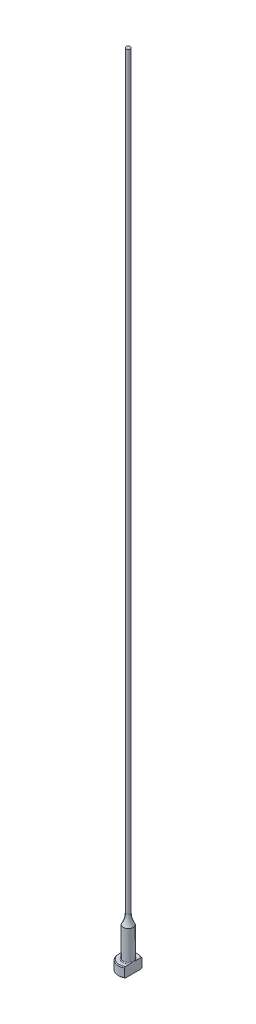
ISO-10303-21;
HEADER;
FILE_DESCRIPTION(('STEP AP214'),'2;1');
FILE_NAME('part.step','',(''),(''),'','','');
FILE_SCHEMA(('AUTOMOTIVE_DESIGN { 1 0 10303 214 1 1 1 1 }'));
ENDSEC;
DATA;
#1=APPLICATION_CONTEXT('core data for automotive mechanical design processes');
#2=APPLICATION_PROTOCOL_DEFINITION('international standard','automotive_design',2000,#1);
#3=PRODUCT_CONTEXT('',#1,'mechanical');
#4=PRODUCT('Part','Part','',(#3));
#5=PRODUCT_RELATED_PRODUCT_CATEGORY('part','',(#4));
#6=PRODUCT_DEFINITION_FORMATION('','',#4);
#7=PRODUCT_DEFINITION_CONTEXT('part definition',#1,'design');
#8=PRODUCT_DEFINITION('design','',#6,#7);
#9=PRODUCT_DEFINITION_SHAPE('','',#8);
#10=(LENGTH_UNIT() NAMED_UNIT(*) SI_UNIT(.MILLI.,.METRE.));
#11=(NAMED_UNIT(*) PLANE_ANGLE_UNIT() SI_UNIT($,.RADIAN.));
#12=(NAMED_UNIT(*) SI_UNIT($,.STERADIAN.) SOLID_ANGLE_UNIT());
#13=UNCERTAINTY_MEASURE_WITH_UNIT(LENGTH_MEASURE(1.E-05),#10,'distance_accuracy_value','');
#14=(GEOMETRIC_REPRESENTATION_CONTEXT(3) GLOBAL_UNCERTAINTY_ASSIGNED_CONTEXT((#13)) GLOBAL_UNIT_ASSIGNED_CONTEXT((#10,
#11,#12)) REPRESENTATION_CONTEXT('',''));
#15=CARTESIAN_POINT('',(0.,0.,0.));
#16=DIRECTION('',(0.,0.,1.));
#17=DIRECTION('',(1.,0.,0.));
#18=AXIS2_PLACEMENT_3D('',#15,#16,#17);
#19=CARTESIAN_POINT('',(-3.17499999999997,3.175,0.));
#20=DIRECTION('',(0.,1.,0.));
#21=DIRECTION('',(0.,0.,1.));
#22=AXIS2_PLACEMENT_3D('',#19,#20,#21);
#23=PLANE('',#22);
#24=CARTESIAN_POINT('',(0.,3.175,0.));
#25=DIRECTION('',(0.,1.,0.));
#26=DIRECTION('',(0.,0.,1.));
#27=AXIS2_PLACEMENT_3D('',#24,#25,#26);
#28=CIRCLE('',#27,2.92099999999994);
#29=CARTESIAN_POINT('',(1.58749999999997,3.175,-2.45195529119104));
#30=VERTEX_POINT('',#29);
#31=CARTESIAN_POINT('',(1.58749999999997,3.175,2.45195529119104));
#32=VERTEX_POINT('',#31);
#33=EDGE_CURVE('E105',#30,#32,#28,.T.);
#34=ORIENTED_EDGE('',*,*,#33,.T.);
#35=DIRECTION('',(0.,0.,1.));
#36=VECTOR('',#35,1.);
#37=CARTESIAN_POINT('',(1.58749999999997,3.17499999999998,2.74963065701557));
#38=LINE('',#37,#36);
#39=CARTESIAN_POINT('',(1.58749999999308,3.175,0.933255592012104));
#40=VERTEX_POINT('',#39);
#41=EDGE_CURVE('E126',#40,#32,#38,.T.);
#42=ORIENTED_EDGE('',*,*,#41,.F.);
#43=CARTESIAN_POINT('',(0.,3.175,0.));
#44=DIRECTION('',(0.,1.,0.));
#45=DIRECTION('',(0.,0.,1.));
#46=AXIS2_PLACEMENT_3D('',#43,#44,#45);
#47=CIRCLE('',#46,1.84149999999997);
#48=CARTESIAN_POINT('',(1.58749999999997,3.17500000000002,-0.933255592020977));
#49=VERTEX_POINT('',#48);
#50=EDGE_CURVE('E11',#40,#49,#47,.F.);
#51=ORIENTED_EDGE('',*,*,#50,.T.);
#52=EDGE_CURVE('E52',#30,#49,#38,.T.);
#53=ORIENTED_EDGE('',*,*,#52,.F.);
#54=EDGE_LOOP('',(#34,#42,#51,#53));
#55=FACE_BOUND('',#54,.T.);
#56=ADVANCED_FACE('F32',(#55),#23,.T.);
#57=CARTESIAN_POINT('',(0.,259.958771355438,0.));
#58=DIRECTION('',(0.,1.,0.));
#59=DIRECTION('',(0.,0.,1.));
#60=AXIS2_PLACEMENT_3D('',#57,#58,#59);
#61=CYLINDRICAL_SURFACE('',#60,3.17499999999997);
#62=CARTESIAN_POINT('',(0.,2.92100000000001,0.));
#63=DIRECTION('',(0.,1.,0.));
#64=DIRECTION('',(0.,0.,1.));
#65=AXIS2_PLACEMENT_3D('',#62,#63,#64);
#66=CIRCLE('',#65,3.17499999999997);
#67=CARTESIAN_POINT('',(1.58749999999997,2.92100000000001,2.74963065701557));
#68=VERTEX_POINT('',#67);
#69=CARTESIAN_POINT('',(1.58749999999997,2.92100000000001,-2.74963065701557));
#70=VERTEX_POINT('',#69);
#71=EDGE_CURVE('E98',#68,#70,#66,.F.);
#72=ORIENTED_EDGE('',*,*,#71,.T.);
#73=DIRECTION('',(0.,-1.,0.));
#74=VECTOR('',#73,1.);
#75=CARTESIAN_POINT('',(1.58749999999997,254.001,-2.74963065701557));
#76=LINE('',#75,#74);
#77=CARTESIAN_POINT('',(1.58749999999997,0.253999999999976,-2.74963065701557));
#78=VERTEX_POINT('',#77);
#79=EDGE_CURVE('E141',#70,#78,#76,.T.);
#80=ORIENTED_EDGE('',*,*,#79,.T.);
#81=CARTESIAN_POINT('',(0.,0.253999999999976,0.));
#82=DIRECTION('',(0.,-1.,0.));
#83=DIRECTION('',(0.,0.,-1.));
#84=AXIS2_PLACEMENT_3D('',#81,#82,#83);
#85=CIRCLE('',#84,3.17499999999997);
#86=CARTESIAN_POINT('',(1.58749999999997,0.253999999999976,2.74963065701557));
#87=VERTEX_POINT('',#86);
#88=EDGE_CURVE('E95',#78,#87,#85,.F.);
#89=ORIENTED_EDGE('',*,*,#88,.T.);
#90=DIRECTION('',(0.,-1.,0.));
#91=VECTOR('',#90,1.);
#92=CARTESIAN_POINT('',(1.58749999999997,254.001,2.74963065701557));
#93=LINE('',#92,#91);
#94=EDGE_CURVE('E88',#68,#87,#93,.T.);
#95=ORIENTED_EDGE('',*,*,#94,.F.);
#96=EDGE_LOOP('',(#72,#80,#89,#95));
#97=FACE_BOUND('',#96,.T.);
#98=ADVANCED_FACE('F191',(#97),#61,.T.);
#99=CARTESIAN_POINT('',(0.,0.,0.));
#100=DIRECTION('',(0.,-1.,0.));
#101=DIRECTION('',(0.,0.,-1.));
#102=AXIS2_PLACEMENT_3D('',#99,#100,#101);
#103=PLANE('',#102);
#104=CARTESIAN_POINT('',(0.,0.,0.));
#105=DIRECTION('',(0.,-1.,0.));
#106=DIRECTION('',(0.,0.,-1.));
#107=AXIS2_PLACEMENT_3D('',#104,#105,#106);
#108=CIRCLE('',#107,2.92100000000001);
#109=CARTESIAN_POINT('',(1.58749999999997,0.,2.45195529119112));
#110=VERTEX_POINT('',#109);
#111=CARTESIAN_POINT('',(1.58749999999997,0.,-2.45195529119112));
#112=VERTEX_POINT('',#111);
#113=EDGE_CURVE('E93',#110,#112,#108,.T.);
#114=ORIENTED_EDGE('',*,*,#113,.T.);
#115=DIRECTION('',(0.,0.,1.));
#116=VECTOR('',#115,1.);
#117=CARTESIAN_POINT('',(1.58749999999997,0.,2.74963065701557));
#118=LINE('',#117,#116);
#119=EDGE_CURVE('E78',#112,#110,#118,.T.);
#120=ORIENTED_EDGE('',*,*,#119,.T.);
#121=EDGE_LOOP('',(#114,#120));
#122=FACE_BOUND('',#121,.T.);
#123=ADVANCED_FACE('F97',(#122),#103,.T.);
#124=CARTESIAN_POINT('',(0.,3.17499999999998,0.));
#125=DIRECTION('',(0.,-1.,0.));
#126=DIRECTION('',(0.,0.,-1.));
#127=AXIS2_PLACEMENT_3D('',#124,#125,#126);
#128=CONICAL_SURFACE('',#127,2.92099999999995,0.785398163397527);
#129=ORIENTED_EDGE('',*,*,#71,.F.);
#130=CARTESIAN_POINT('',(1.58749999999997,-0.16162066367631,-6.0529050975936));
#131=CARTESIAN_POINT('',(1.58749999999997,-0.0288893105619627,-5.91567682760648));
#132=CARTESIAN_POINT('',(1.58749999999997,0.103699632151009,-5.7783103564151));
#133=CARTESIAN_POINT('',(1.58749999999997,0.368508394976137,-5.50321874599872));
#134=CARTESIAN_POINT('',(1.58749999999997,0.500728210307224,-5.36549360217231));
#135=CARTESIAN_POINT('',(1.58749999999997,0.764778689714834,-5.08953516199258));
#136=CARTESIAN_POINT('',(1.58749999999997,0.896609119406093,-4.9513016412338));
#137=CARTESIAN_POINT('',(1.58749999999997,1.15968706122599,-4.67428233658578));
#138=CARTESIAN_POINT('',(1.58749999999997,1.29093457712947,-4.53549655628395));
#139=CARTESIAN_POINT('',(1.58749999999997,1.55007705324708,-4.25997724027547));
#140=CARTESIAN_POINT('',(1.58749999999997,1.67798684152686,-4.12325766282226));
#141=CARTESIAN_POINT('',(1.58749999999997,1.9328486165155,-3.84892898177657));
#142=CARTESIAN_POINT('',(1.58749999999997,2.05980060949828,-3.71131988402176));
#143=CARTESIAN_POINT('',(1.58749999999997,2.31237508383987,-3.43493978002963));
#144=CARTESIAN_POINT('',(1.58749999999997,2.43799784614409,-3.29616903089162));
#145=CARTESIAN_POINT('',(1.58749999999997,2.68741369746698,-3.01699558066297));
#146=CARTESIAN_POINT('',(1.58749999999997,2.81120686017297,-2.8765929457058));
#147=CARTESIAN_POINT('',(1.58749999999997,3.00875865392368,-2.64816703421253));
#148=CARTESIAN_POINT('',(1.58749999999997,3.08336151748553,-2.56087478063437));
#149=CARTESIAN_POINT('',(1.58749999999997,3.2312387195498,-2.38515423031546));
#150=CARTESIAN_POINT('',(1.58749999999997,3.30451292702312,-2.29672582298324));
#151=CARTESIAN_POINT('',(1.58749999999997,3.45004422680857,-2.1174740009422));
#152=CARTESIAN_POINT('',(1.58749999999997,3.5222823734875,-2.02663514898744));
#153=CARTESIAN_POINT('',(1.58749999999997,3.66423097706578,-1.8430252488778));
#154=CARTESIAN_POINT('',(1.58749999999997,3.73394203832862,-1.75025467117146));
#155=CARTESIAN_POINT('',(1.58749999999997,3.87080633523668,-1.5606747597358));
#156=CARTESIAN_POINT('',(1.58749999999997,3.93790459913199,-1.46382547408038));
#157=CARTESIAN_POINT('',(1.58749999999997,4.06669147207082,-1.26632594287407));
#158=CARTESIAN_POINT('',(1.58749999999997,4.1283726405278,-1.16567073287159));
#159=CARTESIAN_POINT('',(1.58749999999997,4.21402252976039,-1.01165766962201));
#160=CARTESIAN_POINT('',(1.58749999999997,4.24127929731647,-0.960142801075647));
#161=CARTESIAN_POINT('',(1.58749999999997,4.2930979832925,-0.855780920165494));
#162=CARTESIAN_POINT('',(1.58749999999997,4.31765941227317,-0.802933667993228));
#163=CARTESIAN_POINT('',(1.58749999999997,4.38614656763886,-0.642461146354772));
#164=CARTESIAN_POINT('',(1.58749999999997,4.42510149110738,-0.532518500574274));
#165=CARTESIAN_POINT('',(1.58749999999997,4.46726244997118,-0.367680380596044));
#166=CARTESIAN_POINT('',(1.58749999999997,4.47844427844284,-0.314802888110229));
#167=CARTESIAN_POINT('',(1.58749999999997,4.49576654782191,-0.208209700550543));
#168=CARTESIAN_POINT('',(1.58749999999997,4.50190743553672,-0.154494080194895));
#169=CARTESIAN_POINT('',(1.58749999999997,4.50871296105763,-0.0468792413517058));
#170=CARTESIAN_POINT('',(1.58749999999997,4.5093945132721,0.00701889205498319));
#171=CARTESIAN_POINT('',(1.58749999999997,4.50527679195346,0.114606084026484));
#172=CARTESIAN_POINT('',(1.58749999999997,4.50047706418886,0.168295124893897));
#173=CARTESIAN_POINT('',(1.58749999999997,4.48579689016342,0.27448544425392));
#174=CARTESIAN_POINT('',(1.58749999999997,4.47596081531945,0.32699298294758));
#175=CARTESIAN_POINT('',(1.58749999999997,4.45181809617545,0.430974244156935));
#176=CARTESIAN_POINT('',(1.58749999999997,4.4375096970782,0.482447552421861));
#177=CARTESIAN_POINT('',(1.58749999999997,4.40502489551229,0.584460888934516));
#178=CARTESIAN_POINT('',(1.58749999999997,4.386827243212,0.634994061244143));
#179=CARTESIAN_POINT('',(1.58749999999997,4.34729308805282,0.734789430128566));
#180=CARTESIAN_POINT('',(1.58749999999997,4.3259572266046,0.784051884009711));
#181=CARTESIAN_POINT('',(1.58749999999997,4.25791922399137,0.930549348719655));
#182=CARTESIAN_POINT('',(1.58749999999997,4.20736047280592,1.0259880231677));
#183=CARTESIAN_POINT('',(1.58749999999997,4.0995545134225,1.21304313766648));
#184=CARTESIAN_POINT('',(1.58749999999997,4.04229912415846,1.30465471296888));
#185=CARTESIAN_POINT('',(1.58749999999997,3.92308746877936,1.48526211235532));
#186=CARTESIAN_POINT('',(1.58749999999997,3.86111349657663,1.57424615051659));
#187=CARTESIAN_POINT('',(1.58749999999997,3.73408621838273,1.74990003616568));
#188=CARTESIAN_POINT('',(1.58749999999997,3.66903444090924,1.83657099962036));
#189=CARTESIAN_POINT('',(1.58749999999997,3.53583371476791,2.00931764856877));
#190=CARTESIAN_POINT('',(1.58749999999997,3.46765527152,2.09537048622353));
#191=CARTESIAN_POINT('',(1.58749999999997,3.32960643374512,2.26611736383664));
#192=CARTESIAN_POINT('',(1.58749999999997,3.25973586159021,2.35081125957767));
#193=CARTESIAN_POINT('',(1.58749999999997,3.04858139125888,2.60290121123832));
#194=CARTESIAN_POINT('',(1.58749999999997,2.90542388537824,2.76872537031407));
#195=CARTESIAN_POINT('',(1.58749999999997,2.64069522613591,3.06970913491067));
#196=CARTESIAN_POINT('',(1.58749999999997,2.51959458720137,3.20528660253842));
#197=CARTESIAN_POINT('',(1.58749999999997,2.27590400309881,3.47510321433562));
#198=CARTESIAN_POINT('',(1.58749999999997,2.15331401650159,3.60934232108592));
#199=CARTESIAN_POINT('',(1.58749999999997,1.90694239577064,3.87695374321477));
#200=CARTESIAN_POINT('',(1.58749999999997,1.78315974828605,4.0103251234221));
#201=CARTESIAN_POINT('',(1.58749999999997,1.53478104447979,4.27630880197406));
#202=CARTESIAN_POINT('',(1.58749999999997,1.41018498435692,4.40892109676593));
#203=CARTESIAN_POINT('',(1.58749999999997,1.0457468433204,4.79499418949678));
#204=CARTESIAN_POINT('',(1.58749999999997,0.80507680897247,5.04767313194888));
#205=CARTESIAN_POINT('',(1.58749999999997,0.443121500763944,5.42550911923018));
#206=CARTESIAN_POINT('',(1.58749999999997,0.322378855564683,5.55118772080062));
#207=CARTESIAN_POINT('',(1.58749999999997,0.0805914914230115,5.80225207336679));
#208=CARTESIAN_POINT('',(1.58749999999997,-0.040453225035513,5.92763782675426));
#209=CARTESIAN_POINT('',(1.58749999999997,-0.161620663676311,6.0529050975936));
#210=B_SPLINE_CURVE_WITH_KNOTS('',3,(#130,#131,#132,#133,#134,#135,#136,#137,#138,#139,#140,
#141,#142,#143,#144,#145,#146,#147,#148,#149,#150,#151,#152,#153,#154,#155,#156,#157,#158,#159,
#160,#161,#162,#163,#164,#165,#166,#167,#168,#169,#170,#171,#172,#173,#174,#175,#176,#177,#178,
#179,#180,#181,#182,#183,#184,#185,#186,#187,#188,#189,#190,#191,#192,#193,#194,#195,#196,#197,
#198,#199,#200,#201,#202,#203,#204,#205,#206,#207,#208,#209),.UNSPECIFIED.,.F.,.F.,(4,2,2,2,2,2,
2,2,2,2,2,2,2,2,2,2,2,2,2,2,2,2,2,2,2,2,2,2,2,2,2,2,2,2,2,2,2,2,2,4),(0.,0.572750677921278,
1.14550874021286,1.71856057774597,2.29160869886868,2.85328006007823,3.4149477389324,
3.97649423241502,4.53801804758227,4.88249307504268,5.22700189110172,5.5751532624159,
5.92322081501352,6.27657800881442,6.63041319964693,6.80518126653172,6.9799810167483,
7.3282426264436,7.49018491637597,7.65211285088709,7.81353889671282,7.97497832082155,
8.13501929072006,8.29512313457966,8.45612518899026,8.61709438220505,8.94062993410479,
9.2645649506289,9.58978187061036,9.91483894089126,10.2441741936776,10.5735441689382,
11.2306812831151,11.7760337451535,12.3214014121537,12.8672825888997,13.4131663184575,
14.4600164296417,14.9828595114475,15.5056983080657),.UNSPECIFIED.);
#211=EDGE_CURVE('E118',#32,#68,#210,.T.);
#212=ORIENTED_EDGE('',*,*,#211,.F.);
#213=ORIENTED_EDGE('',*,*,#33,.F.);
#214=EDGE_CURVE('E117',#70,#30,#210,.T.);
#215=ORIENTED_EDGE('',*,*,#214,.F.);
#216=EDGE_LOOP('',(#129,#212,#213,#215));
#217=FACE_BOUND('',#216,.T.);
#218=ADVANCED_FACE('F162',(#217),#128,.T.);
#219=CARTESIAN_POINT('',(0.,0.253999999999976,0.));
#220=DIRECTION('',(0.,1.,0.));
#221=DIRECTION('',(0.,0.,1.));
#222=AXIS2_PLACEMENT_3D('',#219,#220,#221);
#223=CONICAL_SURFACE('',#222,3.17499999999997,0.785398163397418);
#224=ORIENTED_EDGE('',*,*,#88,.F.);
#225=CARTESIAN_POINT('',(1.58749999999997,3.33662066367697,6.0529050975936));
#226=CARTESIAN_POINT('',(1.58749999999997,3.20388931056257,5.91567682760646));
#227=CARTESIAN_POINT('',(1.58749999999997,3.07130036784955,5.77831035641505));
#228=CARTESIAN_POINT('',(1.58749999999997,2.80649160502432,5.50321874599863));
#229=CARTESIAN_POINT('',(1.58749999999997,2.67427178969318,5.3654936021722));
#230=CARTESIAN_POINT('',(1.58749999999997,2.41022131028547,5.08953516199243));
#231=CARTESIAN_POINT('',(1.58749999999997,2.27839088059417,4.95130164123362));
#232=CARTESIAN_POINT('',(1.58749999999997,2.01531293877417,4.67428233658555));
#233=CARTESIAN_POINT('',(1.58749999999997,1.88406542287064,4.5354965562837));
#234=CARTESIAN_POINT('',(1.58749999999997,1.62492294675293,4.25997724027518));
#235=CARTESIAN_POINT('',(1.58749999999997,1.49701315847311,4.12325766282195));
#236=CARTESIAN_POINT('',(1.58749999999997,1.24215138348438,3.84892898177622));
#237=CARTESIAN_POINT('',(1.58749999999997,1.11519939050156,3.71131988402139));
#238=CARTESIAN_POINT('',(1.58749999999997,0.862624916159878,3.43493978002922));
#239=CARTESIAN_POINT('',(1.58749999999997,0.737002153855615,3.29616903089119));
#240=CARTESIAN_POINT('',(1.58749999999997,0.487586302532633,3.01699558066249));
#241=CARTESIAN_POINT('',(1.58749999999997,0.363793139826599,2.8765929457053));
#242=CARTESIAN_POINT('',(1.58749999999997,0.166241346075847,2.64816703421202));
#243=CARTESIAN_POINT('',(1.58749999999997,0.0916384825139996,2.56087478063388));
#244=CARTESIAN_POINT('',(1.58749999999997,-0.0562387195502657,2.385154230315));
#245=CARTESIAN_POINT('',(1.58749999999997,-0.129512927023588,2.29672582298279));
#246=CARTESIAN_POINT('',(1.58749999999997,-0.27504422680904,2.11747400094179));
#247=CARTESIAN_POINT('',(1.58749999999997,-0.347282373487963,2.02663514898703));
#248=CARTESIAN_POINT('',(1.58749999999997,-0.489230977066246,1.84302524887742));
#249=CARTESIAN_POINT('',(1.58749999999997,-0.558942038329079,1.7502546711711));
#250=CARTESIAN_POINT('',(1.58749999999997,-0.695806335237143,1.56067475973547));
#251=CARTESIAN_POINT('',(1.58749999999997,-0.762904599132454,1.46382547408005));
#252=CARTESIAN_POINT('',(1.58749999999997,-0.891691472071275,1.26632594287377));
#253=CARTESIAN_POINT('',(1.58749999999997,-0.953372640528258,1.16567073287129));
#254=CARTESIAN_POINT('',(1.58749999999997,-1.03902252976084,1.01165766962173));
#255=CARTESIAN_POINT('',(1.58749999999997,-1.06627929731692,0.960142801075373));
#256=CARTESIAN_POINT('',(1.58749999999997,-1.11809798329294,0.85578092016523));
#257=CARTESIAN_POINT('',(1.58749999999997,-1.14265941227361,0.802933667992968));
#258=CARTESIAN_POINT('',(1.58749999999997,-1.21114656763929,0.642461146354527));
#259=CARTESIAN_POINT('',(1.58749999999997,-1.2501014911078,0.532518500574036));
#260=CARTESIAN_POINT('',(1.58749999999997,-1.29226244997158,0.367680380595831));
#261=CARTESIAN_POINT('',(1.58749999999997,-1.30344427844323,0.314802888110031));
#262=CARTESIAN_POINT('',(1.58749999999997,-1.32076654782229,0.208209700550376));
#263=CARTESIAN_POINT('',(1.58749999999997,-1.3269074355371,0.154494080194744));
#264=CARTESIAN_POINT('',(1.58749999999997,-1.333712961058,0.0468792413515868));
#265=CARTESIAN_POINT('',(1.58749999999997,-1.33439451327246,-0.00701889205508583));
#266=CARTESIAN_POINT('',(1.58749999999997,-1.33027679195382,-0.114606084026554));
#267=CARTESIAN_POINT('',(1.58749999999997,-1.32547706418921,-0.168295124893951));
#268=CARTESIAN_POINT('',(1.58749999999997,-1.31079689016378,-0.274485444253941));
#269=CARTESIAN_POINT('',(1.58749999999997,-1.3009608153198,-0.326992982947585));
#270=CARTESIAN_POINT('',(1.58749999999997,-1.27681809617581,-0.430974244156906));
#271=CARTESIAN_POINT('',(1.58749999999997,-1.26250969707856,-0.482447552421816));
#272=CARTESIAN_POINT('',(1.58749999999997,-1.23002489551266,-0.584460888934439));
#273=CARTESIAN_POINT('',(1.58749999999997,-1.21182724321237,-0.634994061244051));
#274=CARTESIAN_POINT('',(1.58749999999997,-1.1722930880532,-0.734789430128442));
#275=CARTESIAN_POINT('',(1.58749999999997,-1.15095722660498,-0.784051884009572));
#276=CARTESIAN_POINT('',(1.58749999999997,-1.08291922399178,-0.93054934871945));
#277=CARTESIAN_POINT('',(1.58749999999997,-1.03236047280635,-1.02598802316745));
#278=CARTESIAN_POINT('',(1.58749999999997,-0.924554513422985,-1.21304313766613));
#279=CARTESIAN_POINT('',(1.58749999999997,-0.86729912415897,-1.30465471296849));
#280=CARTESIAN_POINT('',(1.58749999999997,-0.748087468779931,-1.48526211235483));
#281=CARTESIAN_POINT('',(1.58749999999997,-0.686113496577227,-1.57424615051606));
#282=CARTESIAN_POINT('',(1.58749999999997,-0.55908621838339,-1.74990003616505));
#283=CARTESIAN_POINT('',(1.58749999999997,-0.494034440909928,-1.83657099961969));
#284=CARTESIAN_POINT('',(1.58749999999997,-0.360833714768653,-2.00931764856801));
#285=CARTESIAN_POINT('',(1.58749999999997,-0.292655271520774,-2.09537048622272));
#286=CARTESIAN_POINT('',(1.58749999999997,-0.154606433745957,-2.26611736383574));
#287=CARTESIAN_POINT('',(1.58749999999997,-0.0847358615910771,-2.35081125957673));
#288=CARTESIAN_POINT('',(1.58749999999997,0.126418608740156,-2.60290121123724));
#289=CARTESIAN_POINT('',(1.58749999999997,0.269576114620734,-2.76872537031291));
#290=CARTESIAN_POINT('',(1.58749999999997,0.534304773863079,-3.06970913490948));
#291=CARTESIAN_POINT('',(1.58749999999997,0.655405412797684,-3.20528660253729));
#292=CARTESIAN_POINT('',(1.58749999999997,0.899095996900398,-3.47510321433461));
#293=CARTESIAN_POINT('',(1.58749999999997,1.02168598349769,-3.60934232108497));
#294=CARTESIAN_POINT('',(1.58749999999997,1.26805760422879,-3.87695374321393));
#295=CARTESIAN_POINT('',(1.58749999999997,1.39184025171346,-4.01032512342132));
#296=CARTESIAN_POINT('',(1.58749999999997,1.64021895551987,-4.2763088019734));
#297=CARTESIAN_POINT('',(1.58749999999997,1.76481501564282,-4.40892109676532));
#298=CARTESIAN_POINT('',(1.58749999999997,2.12925315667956,-4.79499418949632));
#299=CARTESIAN_POINT('',(1.58749999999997,2.36992319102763,-5.04767313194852));
#300=CARTESIAN_POINT('',(1.58749999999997,2.73187849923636,-5.42550911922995));
#301=CARTESIAN_POINT('',(1.58749999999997,2.85262114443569,-5.55118772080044));
#302=CARTESIAN_POINT('',(1.58749999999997,3.09440850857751,-5.8022520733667));
#303=CARTESIAN_POINT('',(1.58749999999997,3.2154532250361,-5.92763782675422));
#304=CARTESIAN_POINT('',(1.58749999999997,3.33662066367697,-6.0529050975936));
#305=B_SPLINE_CURVE_WITH_KNOTS('',3,(#225,#226,#227,#228,#229,#230,#231,#232,#233,#234,#235,
#236,#237,#238,#239,#240,#241,#242,#243,#244,#245,#246,#247,#248,#249,#250,#251,#252,#253,#254,
#255,#256,#257,#258,#259,#260,#261,#262,#263,#264,#265,#266,#267,#268,#269,#270,#271,#272,#273,
#274,#275,#276,#277,#278,#279,#280,#281,#282,#283,#284,#285,#286,#287,#288,#289,#290,#291,#292,
#293,#294,#295,#296,#297,#298,#299,#300,#301,#302,#303,#304),.UNSPECIFIED.,.F.,.F.,(4,2,2,2,2,2,
2,2,2,2,2,2,2,2,2,2,2,2,2,2,2,2,2,2,2,2,2,2,2,2,2,2,2,2,2,2,2,2,2,4),(0.,0.57275067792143,
1.14550874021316,1.71856057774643,2.29160869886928,2.85328006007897,3.41494773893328,
3.97649423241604,4.53801804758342,4.88249307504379,5.2270018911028,5.57515326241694,
5.92322081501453,6.27657800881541,6.63041319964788,6.80518126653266,6.97998101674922,
7.32824262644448,7.49018491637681,7.65211285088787,7.81353889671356,7.97497832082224,
8.1350192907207,8.29512313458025,8.45612518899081,8.61709438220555,8.94062993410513,
9.26456495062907,9.58978187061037,9.91483894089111,10.2441741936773,10.5735441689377,
11.2306812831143,11.776033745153,12.3214014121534,12.8672825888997,13.4131663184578,
14.4600164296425,14.9828595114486,15.505698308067),.UNSPECIFIED.);
#306=EDGE_CURVE('E81',#112,#78,#305,.T.);
#307=ORIENTED_EDGE('',*,*,#306,.F.);
#308=ORIENTED_EDGE('',*,*,#113,.F.);
#309=EDGE_CURVE('E84',#87,#110,#305,.T.);
#310=ORIENTED_EDGE('',*,*,#309,.F.);
#311=EDGE_LOOP('',(#224,#307,#308,#310));
#312=FACE_BOUND('',#311,.T.);
#313=ADVANCED_FACE('F92',(#312),#223,.T.);
#314=CARTESIAN_POINT('',(0.,3.42900000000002,0.));
#315=DIRECTION('',(0.,1.,0.));
#316=DIRECTION('',(0.,0.,1.));
#317=AXIS2_PLACEMENT_3D('',#314,#315,#316);
#318=TOROIDAL_SURFACE('',#317,1.84149999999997,0.254);
#319=CARTESIAN_POINT('',(1.58749999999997,3.42900000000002,0.));
#320=CARTESIAN_POINT('',(1.58749999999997,3.42899942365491,-1.9220514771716E-10));
#321=CARTESIAN_POINT('',(1.58749999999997,3.42899884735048,-1.2261161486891E-07));
#322=CARTESIAN_POINT('',(1.58749999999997,3.42899773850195,-5.09676365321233E-07));
#323=CARTESIAN_POINT('',(1.58749999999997,3.42899720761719,-7.78176328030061E-07));
#324=CARTESIAN_POINT('',(1.58749999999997,3.42899614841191,-1.42307272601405E-06));
#325=CARTESIAN_POINT('',(1.58749999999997,3.42899562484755,-1.80713867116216E-06));
#326=CARTESIAN_POINT('',(1.58749999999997,3.42899463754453,-2.63494846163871E-06));
#327=CARTESIAN_POINT('',(1.58749999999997,3.42899417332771,-3.07814756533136E-06));
#328=CARTESIAN_POINT('',(1.58749999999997,3.42899261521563,-4.66897357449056E-06));
#329=CARTESIAN_POINT('',(1.58749999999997,3.42899159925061,-5.89404908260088E-06));
#330=CARTESIAN_POINT('',(1.58749999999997,3.42898979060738,-8.42427511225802E-06));
#331=CARTESIAN_POINT('',(1.58749999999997,3.42898899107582,-9.7248057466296E-06));
#332=CARTESIAN_POINT('',(1.58749999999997,3.42898598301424,-1.48060601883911E-05));
#333=CARTESIAN_POINT('',(1.58749999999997,3.42898393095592,-1.86838281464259E-05));
#334=CARTESIAN_POINT('',(1.58749999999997,3.42898057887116,-2.63261117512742E-05));
#335=CARTESIAN_POINT('',(1.58749999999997,3.42897922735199,-3.00687417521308E-05));
#336=CARTESIAN_POINT('',(1.58749999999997,3.42897347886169,-4.60276298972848E-05));
#337=CARTESIAN_POINT('',(1.58749999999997,3.42896911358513,-5.8247019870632E-05));
#338=CARTESIAN_POINT('',(1.58749999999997,3.42896211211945,-8.11070097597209E-05));
#339=CARTESIAN_POINT('',(1.58749999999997,3.42895931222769,-9.16953114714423E-05));
#340=CARTESIAN_POINT('',(1.58749999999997,3.42893712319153,-0.000168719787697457));
#341=CARTESIAN_POINT('',(1.58749999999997,3.42890881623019,-0.000232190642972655));
#342=CARTESIAN_POINT('',(1.58749999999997,3.42880276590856,-0.000479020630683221));
#343=CARTESIAN_POINT('',(1.58749999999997,3.42873165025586,-0.00066443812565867));
#344=CARTESIAN_POINT('',(1.58749999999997,3.42845137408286,-0.0013844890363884));
#345=CARTESIAN_POINT('',(1.58749999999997,3.42823526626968,-0.00191701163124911));
#346=CARTESIAN_POINT('',(1.58749999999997,3.42735449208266,-0.00409774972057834));
#347=CARTESIAN_POINT('',(1.58749999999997,3.42669768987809,-0.00574830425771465));
#348=CARTESIAN_POINT('',(1.58749999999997,3.4174405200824,-0.0289985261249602));
#349=CARTESIAN_POINT('',(1.58749999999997,3.40878325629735,-0.0505816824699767));
#350=CARTESIAN_POINT('',(1.58749999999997,3.39189297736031,-0.0929947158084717));
#351=CARTESIAN_POINT('',(1.58749999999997,3.38365605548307,-0.11382315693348));
#352=CARTESIAN_POINT('',(1.58749999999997,3.36635393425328,-0.157956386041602));
#353=CARTESIAN_POINT('',(1.58749999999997,3.35730391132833,-0.181267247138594));
#354=CARTESIAN_POINT('',(1.58749999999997,3.33936775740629,-0.228222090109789));
#355=CARTESIAN_POINT('',(1.58749999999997,3.33048420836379,-0.25186705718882));
#356=CARTESIAN_POINT('',(1.58749999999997,3.30894496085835,-0.310512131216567));
#357=CARTESIAN_POINT('',(1.58749999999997,3.29649449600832,-0.345588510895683));
#358=CARTESIAN_POINT('',(1.58749999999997,3.27296975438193,-0.415278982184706));
#359=CARTESIAN_POINT('',(1.58749999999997,3.26186987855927,-0.449884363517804));
#360=CARTESIAN_POINT('',(1.58749999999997,3.2395832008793,-0.524471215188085));
#361=CARTESIAN_POINT('',(1.58749999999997,3.22860862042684,-0.564517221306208));
#362=CARTESIAN_POINT('',(1.58749999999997,3.20902534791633,-0.645529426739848));
#363=CARTESIAN_POINT('',(1.58749999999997,3.20043582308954,-0.686500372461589));
#364=CARTESIAN_POINT('',(1.58749999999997,3.18611712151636,-0.771546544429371));
#365=CARTESIAN_POINT('',(1.58749999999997,3.18059550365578,-0.815658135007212));
#366=CARTESIAN_POINT('',(1.58749999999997,3.17455396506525,-0.904117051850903));
#367=CARTESIAN_POINT('',(1.58749999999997,3.17401361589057,-0.948462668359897));
#368=CARTESIAN_POINT('',(1.58749999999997,3.17898948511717,-1.02531896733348));
#369=CARTESIAN_POINT('',(1.58749999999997,3.1829739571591,-1.05792141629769));
#370=CARTESIAN_POINT('',(1.58749999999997,3.19569167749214,-1.12184393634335));
#371=CARTESIAN_POINT('',(1.58749999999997,3.20436049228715,-1.1531753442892));
#372=CARTESIAN_POINT('',(1.58749999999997,3.22236152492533,-1.19946468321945));
#373=CARTESIAN_POINT('',(1.58749999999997,3.2295150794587,-1.21526783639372));
#374=CARTESIAN_POINT('',(1.58749999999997,3.24587062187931,-1.24583726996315));
#375=CARTESIAN_POINT('',(1.58749999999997,3.25507530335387,-1.26060215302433));
#376=CARTESIAN_POINT('',(1.58749999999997,3.27378481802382,-1.28575815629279));
#377=CARTESIAN_POINT('',(1.58749999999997,3.28289001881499,-1.29644383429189));
#378=CARTESIAN_POINT('',(1.58749999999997,3.30268460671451,-1.31623154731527));
#379=CARTESIAN_POINT('',(1.58749999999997,3.31337067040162,-1.32533681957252));
#380=CARTESIAN_POINT('',(1.58749999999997,3.33349977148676,-1.33941140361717));
#381=CARTESIAN_POINT('',(1.58749999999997,3.34261446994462,-1.34484814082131));
#382=CARTESIAN_POINT('',(1.58749999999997,3.36161455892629,-1.35416329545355));
#383=CARTESIAN_POINT('',(1.58749999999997,3.37149946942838,-1.35804267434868));
#384=CARTESIAN_POINT('',(1.58749999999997,3.39188678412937,-1.36398436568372));
#385=CARTESIAN_POINT('',(1.58749999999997,3.40239309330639,-1.36603350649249));
#386=CARTESIAN_POINT('',(1.58749999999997,3.42360372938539,-1.3680840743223));
#387=CARTESIAN_POINT('',(1.58749999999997,3.43430795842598,-1.36808648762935));
#388=CARTESIAN_POINT('',(1.58749999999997,3.45433283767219,-1.36616208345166));
#389=CARTESIAN_POINT('',(1.58749999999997,3.46367506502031,-1.36444960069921));
#390=CARTESIAN_POINT('',(1.58749999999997,3.48195519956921,-1.35953338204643));
#391=CARTESIAN_POINT('',(1.58749999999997,3.49089304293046,-1.3563294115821));
#392=CARTESIAN_POINT('',(1.58749999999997,3.50850302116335,-1.34848006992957));
#393=CARTESIAN_POINT('',(1.58749999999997,3.5171531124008,-1.34378578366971));
#394=CARTESIAN_POINT('',(1.58749999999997,3.53371257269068,-1.33324445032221));
#395=CARTESIAN_POINT('',(1.58749999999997,3.54162163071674,-1.32739692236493));
#396=CARTESIAN_POINT('',(1.58749999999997,3.56107121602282,-1.31107304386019));
#397=CARTESIAN_POINT('',(1.58749999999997,3.57202221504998,-1.29989286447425));
#398=CARTESIAN_POINT('',(1.58749999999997,3.59202509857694,-1.27593566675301));
#399=CARTESIAN_POINT('',(1.58749999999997,3.60107086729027,-1.26315370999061));
#400=CARTESIAN_POINT('',(1.58749999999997,3.62186023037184,-1.22930733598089));
#401=CARTESIAN_POINT('',(1.58749999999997,3.63240584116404,-1.20751096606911));
#402=CARTESIAN_POINT('',(1.58749999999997,3.65004643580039,-1.16266144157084));
#403=CARTESIAN_POINT('',(1.58749999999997,3.65714435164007,-1.13960937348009));
#404=CARTESIAN_POINT('',(1.58749999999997,3.67265428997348,-1.07603916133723));
#405=CARTESIAN_POINT('',(1.58749999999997,3.67834921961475,-1.03486686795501));
#406=CARTESIAN_POINT('',(1.58749999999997,3.68382880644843,-0.951558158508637));
#407=CARTESIAN_POINT('',(1.58749999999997,3.68350976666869,-0.909417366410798));
#408=CARTESIAN_POINT('',(1.58749999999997,3.67745397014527,-0.811383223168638));
#409=CARTESIAN_POINT('',(1.58749999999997,3.66993873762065,-0.755610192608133));
#410=CARTESIAN_POINT('',(1.58749999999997,3.64933373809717,-0.644937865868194));
#411=CARTESIAN_POINT('',(1.58749999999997,3.63621897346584,-0.59004364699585));
#412=CARTESIAN_POINT('',(1.58749999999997,3.60740922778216,-0.485757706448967));
#413=CARTESIAN_POINT('',(1.58749999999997,3.59201096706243,-0.436281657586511));
#414=CARTESIAN_POINT('',(1.58749999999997,3.55922497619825,-0.338551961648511));
#415=CARTESIAN_POINT('',(1.58749999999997,3.5418584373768,-0.290291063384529));
#416=CARTESIAN_POINT('',(1.58749999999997,3.51760237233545,-0.225557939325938));
#417=CARTESIAN_POINT('',(1.58749999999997,3.51126413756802,-0.208874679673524));
#418=CARTESIAN_POINT('',(1.58749999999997,3.49830042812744,-0.17512392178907));
#419=CARTESIAN_POINT('',(1.58749999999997,3.49167176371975,-0.158057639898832));
#420=CARTESIAN_POINT('',(1.58749999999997,3.47585523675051,-0.117638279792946));
#421=CARTESIAN_POINT('',(1.58749999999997,3.46662970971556,-0.0943002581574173));
#422=CARTESIAN_POINT('',(1.58749999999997,3.44889695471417,-0.0497824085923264));
#423=CARTESIAN_POINT('',(1.58749999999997,3.44040039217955,-0.028598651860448));
#424=CARTESIAN_POINT('',(1.58749999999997,3.43130364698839,-0.00575168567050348));
#425=CARTESIAN_POINT('',(1.58749999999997,3.43064818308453,-0.00410451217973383));
#426=CARTESIAN_POINT('',(1.58749999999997,3.42976776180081,-0.00192459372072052));
#427=CARTESIAN_POINT('',(1.58749999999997,3.42955062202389,-0.00138952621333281));
#428=CARTESIAN_POINT('',(1.58749999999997,3.42926908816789,-0.000666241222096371));
#429=CARTESIAN_POINT('',(1.58749999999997,3.42919771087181,-0.000480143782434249));
#430=CARTESIAN_POINT('',(1.58749999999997,3.42909131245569,-0.000232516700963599));
#431=CARTESIAN_POINT('',(1.58749999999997,3.42906294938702,-0.000168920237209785));
#432=CARTESIAN_POINT('',(1.58749999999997,3.42904072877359,-9.17527162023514E-05));
#433=CARTESIAN_POINT('',(1.58749999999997,3.42903792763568,-8.11550293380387E-05));
#434=CARTESIAN_POINT('',(1.58749999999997,3.42903091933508,-5.82743948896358E-05));
#435=CARTESIAN_POINT('',(1.58749999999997,3.42902654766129,-4.60440001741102E-05));
#436=CARTESIAN_POINT('',(1.58749999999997,3.42902079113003,-3.00727682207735E-05));
#437=CARTESIAN_POINT('',(1.58749999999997,3.42901943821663,-2.63286807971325E-05));
#438=CARTESIAN_POINT('',(1.58749999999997,3.42901608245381,-1.86836529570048E-05));
#439=CARTESIAN_POINT('',(1.58749999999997,3.4290140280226,-1.48046517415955E-05));
#440=CARTESIAN_POINT('',(1.58749999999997,3.42901101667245,-9.72223943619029E-06));
#441=CARTESIAN_POINT('',(1.58749999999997,3.42901021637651,-8.42159649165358E-06));
#442=CARTESIAN_POINT('',(1.58749999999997,3.42900840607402,-5.89129729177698E-06));
#443=CARTESIAN_POINT('',(1.58749999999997,3.42900738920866,-4.66626867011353E-06));
#444=CARTESIAN_POINT('',(1.58749999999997,3.42900582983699,-3.07568803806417E-06));
#445=CARTESIAN_POINT('',(1.58749999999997,3.42900536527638,-2.63259565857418E-06));
#446=CARTESIAN_POINT('',(1.58749999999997,3.4290043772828,-1.80506085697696E-06));
#447=CARTESIAN_POINT('',(1.58749999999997,3.42900385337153,-1.42116387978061E-06));
#448=CARTESIAN_POINT('',(1.58749999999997,3.42900279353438,-7.76675643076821E-07));
#449=CARTESIAN_POINT('',(1.58749999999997,3.42900226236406,-5.08406487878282E-07));
#450=CARTESIAN_POINT('',(1.58749999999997,3.42900115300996,-1.21901887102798E-07));
#451=CARTESIAN_POINT('',(1.58749999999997,3.42900057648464,1.92251677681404E-10));
#452=CARTESIAN_POINT('',(1.58749999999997,3.42900000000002,0.));
#453=B_SPLINE_CURVE_WITH_KNOTS('',3,(#319,#320,#321,#322,#323,#324,#325,#326,#327,#328,#329,
#330,#331,#332,#333,#334,#335,#336,#337,#338,#339,#340,#341,#342,#343,#344,#345,#346,#347,#348,
#349,#350,#351,#352,#353,#354,#355,#356,#357,#358,#359,#360,#361,#362,#363,#364,#365,#366,#367,
#368,#369,#370,#371,#372,#373,#374,#375,#376,#377,#378,#379,#380,#381,#382,#383,#384,#385,#386,
#387,#388,#389,#390,#391,#392,#393,#394,#395,#396,#397,#398,#399,#400,#401,#402,#403,#404,#405,
#406,#407,#408,#409,#410,#411,#412,#413,#414,#415,#416,#417,#418,#419,#420,#421,#422,#423,#424,
#425,#426,#427,#428,#429,#430,#431,#432,#433,#434,#435,#436,#437,#438,#439,#440,#441,#442,#443,
#444,#445,#446,#447,#448,#449,#450,#451,#452),.UNSPECIFIED.,.T.,.F.,(4,2,2,2,2,2,2,2,2,2,2,2,2,
2,2,2,2,2,2,2,2,2,2,2,2,2,2,2,2,2,2,2,2,2,2,2,2,2,2,2,2,2,2,2,2,2,2,2,2,2,2,2,2,2,2,2,2,2,2,2,2,
2,2,2,2,2,4),(0.,1.72815458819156E-06,3.50429255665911E-06,5.44431004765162E-06,
7.3675525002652E-06,1.2119089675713E-05,1.66953775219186E-05,2.98160400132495E-05,
4.17409564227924E-05,8.0660475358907E-05,0.000113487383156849,0.000321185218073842,
0.000917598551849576,0.00264089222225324,0.00797105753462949,0.0777276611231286,
0.144923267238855,0.219939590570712,0.295714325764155,0.407362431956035,0.516367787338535,
0.640878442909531,0.766362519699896,0.899536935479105,1.03216495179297,1.13045740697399,
1.22743103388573,1.27935899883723,1.33135556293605,1.37333248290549,1.41522237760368,
1.44693946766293,1.47863694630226,1.51056074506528,1.54246916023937,1.57083210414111,
1.59919951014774,1.62861579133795,1.65804436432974,1.70472658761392,1.75155645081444,
1.82378709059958,1.89595619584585,2.01995471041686,2.1460932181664,2.31447224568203,
2.48361094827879,2.6389891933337,2.79283011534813,2.84637031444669,2.9012946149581,
2.97658236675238,3.04504771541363,3.05036697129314,3.05209849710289,3.05269709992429,
3.05290520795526,3.05293806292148,3.05297701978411,3.05298895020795,3.05300207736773,
3.05300665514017,3.0530114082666,3.05301333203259,3.05301527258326,3.05301704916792,
3.05301877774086),.UNSPECIFIED.);
#454=CARTESIAN_POINT('',(1.58749999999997,3.42900000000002,0.));
#455=VERTEX_POINT('',#454);
#456=EDGE_CURVE('E47',#455,#49,#453,.T.);
#457=ORIENTED_EDGE('',*,*,#456,.T.);
#458=ORIENTED_EDGE('',*,*,#50,.F.);
#459=CARTESIAN_POINT('',(1.58749999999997,3.42900000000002,0.));
#460=CARTESIAN_POINT('',(1.58749999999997,3.42900057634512,1.9220512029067E-10));
#461=CARTESIAN_POINT('',(1.58749999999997,3.42900115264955,1.22611614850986E-07));
#462=CARTESIAN_POINT('',(1.58749999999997,3.42900226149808,5.09676365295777E-07));
#463=CARTESIAN_POINT('',(1.58749999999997,3.42900279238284,7.78176328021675E-07));
#464=CARTESIAN_POINT('',(1.58749999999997,3.42900385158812,1.42307272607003E-06));
#465=CARTESIAN_POINT('',(1.58749999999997,3.42900437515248,1.80713867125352E-06));
#466=CARTESIAN_POINT('',(1.58749999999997,3.4290053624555,2.63494846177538E-06));
#467=CARTESIAN_POINT('',(1.58749999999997,3.42900582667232,3.0781475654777E-06));
#468=CARTESIAN_POINT('',(1.58749999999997,3.4290073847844,4.66897357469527E-06));
#469=CARTESIAN_POINT('',(1.58749999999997,3.42900840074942,5.89404908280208E-06));
#470=CARTESIAN_POINT('',(1.58749999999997,3.42901020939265,8.42427511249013E-06));
#471=CARTESIAN_POINT('',(1.58749999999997,3.42901100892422,9.72480574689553E-06));
#472=CARTESIAN_POINT('',(1.58749999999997,3.42901401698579,1.48060601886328E-05));
#473=CARTESIAN_POINT('',(1.58749999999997,3.42901606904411,1.86838281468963E-05));
#474=CARTESIAN_POINT('',(1.58749999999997,3.42901942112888,2.63261117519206E-05));
#475=CARTESIAN_POINT('',(1.58749999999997,3.42902077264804,3.00687417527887E-05));
#476=CARTESIAN_POINT('',(1.58749999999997,3.42902652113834,4.60276298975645E-05));
#477=CARTESIAN_POINT('',(1.58749999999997,3.4290308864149,5.82470198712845E-05));
#478=CARTESIAN_POINT('',(1.58749999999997,3.42903788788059,8.11070097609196E-05));
#479=CARTESIAN_POINT('',(1.58749999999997,3.42904068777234,9.16953114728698E-05));
#480=CARTESIAN_POINT('',(1.58749999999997,3.4290628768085,0.000168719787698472));
#481=CARTESIAN_POINT('',(1.58749999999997,3.42909118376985,0.000232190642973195));
#482=CARTESIAN_POINT('',(1.58749999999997,3.42919723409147,0.000479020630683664));
#483=CARTESIAN_POINT('',(1.58749999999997,3.42926834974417,0.000664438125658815));
#484=CARTESIAN_POINT('',(1.58749999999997,3.42954862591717,0.00138448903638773));
#485=CARTESIAN_POINT('',(1.58749999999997,3.42976473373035,0.00191701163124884));
#486=CARTESIAN_POINT('',(1.58749999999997,3.43064550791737,0.00409774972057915));
#487=CARTESIAN_POINT('',(1.58749999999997,3.43130231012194,0.00574830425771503));
#488=CARTESIAN_POINT('',(1.58749999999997,3.44055947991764,0.0289985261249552));
#489=CARTESIAN_POINT('',(1.58749999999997,3.44921674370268,0.0505816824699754));
#490=CARTESIAN_POINT('',(1.58749999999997,3.46610702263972,0.0929947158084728));
#491=CARTESIAN_POINT('',(1.58749999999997,3.47434394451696,0.11382315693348));
#492=CARTESIAN_POINT('',(1.58749999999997,3.49164606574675,0.157956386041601));
#493=CARTESIAN_POINT('',(1.58749999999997,3.5006960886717,0.181267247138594));
#494=CARTESIAN_POINT('',(1.58749999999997,3.51863224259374,0.228222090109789));
#495=CARTESIAN_POINT('',(1.58749999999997,3.52751579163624,0.25186705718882));
#496=CARTESIAN_POINT('',(1.58749999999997,3.54905503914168,0.310512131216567));
#497=CARTESIAN_POINT('',(1.58749999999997,3.56150550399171,0.345588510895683));
#498=CARTESIAN_POINT('',(1.58749999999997,3.5850302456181,0.415278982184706));
#499=CARTESIAN_POINT('',(1.58749999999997,3.59613012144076,0.449884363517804));
#500=CARTESIAN_POINT('',(1.58749999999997,3.61841679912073,0.524471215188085));
#501=CARTESIAN_POINT('',(1.58749999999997,3.62939137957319,0.564517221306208));
#502=CARTESIAN_POINT('',(1.58749999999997,3.6489746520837,0.645529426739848));
#503=CARTESIAN_POINT('',(1.58749999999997,3.65756417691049,0.686500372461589));
#504=CARTESIAN_POINT('',(1.58749999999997,3.67188287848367,0.771546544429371));
#505=CARTESIAN_POINT('',(1.58749999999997,3.67740449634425,0.815658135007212));
#506=CARTESIAN_POINT('',(1.58749999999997,3.68344603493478,0.904117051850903));
#507=CARTESIAN_POINT('',(1.58749999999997,3.68398638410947,0.948462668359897));
#508=CARTESIAN_POINT('',(1.58749999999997,3.67901051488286,1.02531896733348));
#509=CARTESIAN_POINT('',(1.58749999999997,3.67502604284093,1.05792141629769));
#510=CARTESIAN_POINT('',(1.58749999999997,3.66230832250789,1.12184393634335));
#511=CARTESIAN_POINT('',(1.58749999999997,3.65363950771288,1.1531753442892));
#512=CARTESIAN_POINT('',(1.58749999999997,3.6356384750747,1.19946468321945));
#513=CARTESIAN_POINT('',(1.58749999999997,3.62848492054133,1.21526783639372));
#514=CARTESIAN_POINT('',(1.58749999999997,3.61212937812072,1.24583726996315));
#515=CARTESIAN_POINT('',(1.58749999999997,3.60292469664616,1.26060215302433));
#516=CARTESIAN_POINT('',(1.58749999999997,3.58421518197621,1.28575815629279));
#517=CARTESIAN_POINT('',(1.58749999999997,3.57510998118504,1.29644383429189));
#518=CARTESIAN_POINT('',(1.58749999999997,3.55531539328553,1.31623154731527));
#519=CARTESIAN_POINT('',(1.58749999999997,3.54462932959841,1.32533681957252));
#520=CARTESIAN_POINT('',(1.58749999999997,3.52450022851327,1.33941140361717));
#521=CARTESIAN_POINT('',(1.58749999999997,3.51538553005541,1.34484814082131));
#522=CARTESIAN_POINT('',(1.58749999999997,3.49638544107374,1.35416329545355));
#523=CARTESIAN_POINT('',(1.58749999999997,3.48650053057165,1.35804267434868));
#524=CARTESIAN_POINT('',(1.58749999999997,3.46611321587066,1.36398436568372));
#525=CARTESIAN_POINT('',(1.58749999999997,3.45560690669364,1.36603350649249));
#526=CARTESIAN_POINT('',(1.58749999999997,3.43439627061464,1.3680840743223));
#527=CARTESIAN_POINT('',(1.58749999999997,3.42369204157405,1.36808648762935));
#528=CARTESIAN_POINT('',(1.58749999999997,3.40366716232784,1.36616208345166));
#529=CARTESIAN_POINT('',(1.58749999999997,3.39432493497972,1.36444960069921));
#530=CARTESIAN_POINT('',(1.58749999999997,3.37604480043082,1.35953338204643));
#531=CARTESIAN_POINT('',(1.58749999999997,3.36710695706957,1.3563294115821));
#532=CARTESIAN_POINT('',(1.58749999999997,3.34949697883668,1.34848006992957));
#533=CARTESIAN_POINT('',(1.58749999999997,3.34084688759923,1.34378578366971));
#534=CARTESIAN_POINT('',(1.58749999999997,3.32428742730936,1.33324445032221));
#535=CARTESIAN_POINT('',(1.58749999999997,3.31637836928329,1.32739692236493));
#536=CARTESIAN_POINT('',(1.58749999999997,3.29692878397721,1.31107304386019));
#537=CARTESIAN_POINT('',(1.58749999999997,3.28597778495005,1.29989286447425));
#538=CARTESIAN_POINT('',(1.58749999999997,3.26597490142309,1.27593566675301));
#539=CARTESIAN_POINT('',(1.58749999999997,3.25692913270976,1.26315370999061));
#540=CARTESIAN_POINT('',(1.58749999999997,3.23613976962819,1.22930733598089));
#541=CARTESIAN_POINT('',(1.58749999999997,3.22559415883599,1.20751096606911));
#542=CARTESIAN_POINT('',(1.58749999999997,3.20795356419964,1.16266144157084));
#543=CARTESIAN_POINT('',(1.58749999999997,3.20085564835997,1.13960937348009));
#544=CARTESIAN_POINT('',(1.58749999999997,3.18534571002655,1.07603916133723));
#545=CARTESIAN_POINT('',(1.58749999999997,3.17965078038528,1.03486686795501));
#546=CARTESIAN_POINT('',(1.58749999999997,3.1741711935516,0.951558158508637));
#547=CARTESIAN_POINT('',(1.58749999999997,3.17449023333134,0.909417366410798));
#548=CARTESIAN_POINT('',(1.58749999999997,3.18054602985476,0.811383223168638));
#549=CARTESIAN_POINT('',(1.58749999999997,3.18806126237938,0.755610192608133));
#550=CARTESIAN_POINT('',(1.58749999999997,3.20866626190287,0.644937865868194));
#551=CARTESIAN_POINT('',(1.58749999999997,3.2217810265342,0.59004364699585));
#552=CARTESIAN_POINT('',(1.58749999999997,3.25059077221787,0.485757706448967));
#553=CARTESIAN_POINT('',(1.58749999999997,3.2659890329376,0.43628165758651));
#554=CARTESIAN_POINT('',(1.58749999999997,3.29877502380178,0.338551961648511));
#555=CARTESIAN_POINT('',(1.58749999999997,3.31614156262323,0.290291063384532));
#556=CARTESIAN_POINT('',(1.58749999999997,3.34039762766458,0.225557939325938));
#557=CARTESIAN_POINT('',(1.58749999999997,3.346735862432,0.208874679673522));
#558=CARTESIAN_POINT('',(1.58749999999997,3.35969957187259,0.175123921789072));
#559=CARTESIAN_POINT('',(1.58749999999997,3.3663282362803,0.15805763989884));
#560=CARTESIAN_POINT('',(1.58749999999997,3.3821447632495,0.117638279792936));
#561=CARTESIAN_POINT('',(1.58749999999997,3.39137029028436,0.0943002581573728));
#562=CARTESIAN_POINT('',(1.58749999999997,3.40910304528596,0.0497824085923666));
#563=CARTESIAN_POINT('',(1.58749999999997,3.41759960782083,0.0285986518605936));
#564=CARTESIAN_POINT('',(1.58749999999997,3.42669635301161,0.00575168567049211));
#565=CARTESIAN_POINT('',(1.58749999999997,3.42735181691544,0.00410451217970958));
#566=CARTESIAN_POINT('',(1.58749999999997,3.42823223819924,0.00192459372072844));
#567=CARTESIAN_POINT('',(1.58749999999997,3.42844937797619,0.00138952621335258));
#568=CARTESIAN_POINT('',(1.58749999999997,3.42873091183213,0.000666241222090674));
#569=CARTESIAN_POINT('',(1.58749999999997,3.42880228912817,0.000480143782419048));
#570=CARTESIAN_POINT('',(1.58749999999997,3.42890868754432,0.000232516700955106));
#571=CARTESIAN_POINT('',(1.58749999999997,3.42893705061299,0.000168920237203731));
#572=CARTESIAN_POINT('',(1.58749999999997,3.42895927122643,9.17527161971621E-05));
#573=CARTESIAN_POINT('',(1.58749999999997,3.42896207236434,8.1155029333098E-05));
#574=CARTESIAN_POINT('',(1.58749999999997,3.42896908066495,5.82743948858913E-05));
#575=CARTESIAN_POINT('',(1.58749999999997,3.42897345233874,4.60440001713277E-05));
#576=CARTESIAN_POINT('',(1.58749999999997,3.42897920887,3.00727682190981E-05));
#577=CARTESIAN_POINT('',(1.58749999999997,3.42898056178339,2.63286807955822E-05));
#578=CARTESIAN_POINT('',(1.58749999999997,3.42898391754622,1.86836529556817E-05));
#579=CARTESIAN_POINT('',(1.58749999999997,3.42898597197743,1.48046517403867E-05));
#580=CARTESIAN_POINT('',(1.58749999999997,3.42898898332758,9.72223943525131E-06));
#581=CARTESIAN_POINT('',(1.58749999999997,3.42898978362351,8.42159649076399E-06));
#582=CARTESIAN_POINT('',(1.58749999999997,3.42899159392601,5.89129729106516E-06));
#583=CARTESIAN_POINT('',(1.58749999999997,3.42899261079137,4.66626866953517E-06));
#584=CARTESIAN_POINT('',(1.58749999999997,3.42899417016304,3.0756880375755E-06));
#585=CARTESIAN_POINT('',(1.58749999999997,3.42899463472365,2.63259565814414E-06));
#586=CARTESIAN_POINT('',(1.58749999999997,3.42899562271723,1.80506085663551E-06));
#587=CARTESIAN_POINT('',(1.58749999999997,3.42899614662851,1.42116387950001E-06));
#588=CARTESIAN_POINT('',(1.58749999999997,3.42899720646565,7.7667564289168E-07));
#589=CARTESIAN_POINT('',(1.58749999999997,3.42899773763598,5.0840648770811E-07));
#590=CARTESIAN_POINT('',(1.58749999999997,3.42899884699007,1.21901887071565E-07));
#591=CARTESIAN_POINT('',(1.58749999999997,3.42899942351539,-1.92251650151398E-10));
#592=CARTESIAN_POINT('',(1.58749999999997,3.42900000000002,0.));
#593=B_SPLINE_CURVE_WITH_KNOTS('',3,(#459,#460,#461,#462,#463,#464,#465,#466,#467,#468,#469,
#470,#471,#472,#473,#474,#475,#476,#477,#478,#479,#480,#481,#482,#483,#484,#485,#486,#487,#488,
#489,#490,#491,#492,#493,#494,#495,#496,#497,#498,#499,#500,#501,#502,#503,#504,#505,#506,#507,
#508,#509,#510,#511,#512,#513,#514,#515,#516,#517,#518,#519,#520,#521,#522,#523,#524,#525,#526,
#527,#528,#529,#530,#531,#532,#533,#534,#535,#536,#537,#538,#539,#540,#541,#542,#543,#544,#545,
#546,#547,#548,#549,#550,#551,#552,#553,#554,#555,#556,#557,#558,#559,#560,#561,#562,#563,#564,
#565,#566,#567,#568,#569,#570,#571,#572,#573,#574,#575,#576,#577,#578,#579,#580,#581,#582,#583,
#584,#585,#586,#587,#588,#589,#590,#591,#592),.UNSPECIFIED.,.T.,.F.,(4,2,2,2,2,2,2,2,2,2,2,2,2,
2,2,2,2,2,2,2,2,2,2,2,2,2,2,2,2,2,2,2,2,2,2,2,2,2,2,2,2,2,2,2,2,2,2,2,2,2,2,2,2,2,2,2,2,2,2,2,2,
2,2,2,2,2,4),(0.,1.72815458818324E-06,3.50429255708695E-06,5.44431004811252E-06,
7.36755250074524E-06,1.21190896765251E-05,1.66953775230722E-05,2.98160400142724E-05,
4.17409564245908E-05,8.06604753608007E-05,0.000113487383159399,0.000321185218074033,
0.000917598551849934,0.00264089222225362,0.00797105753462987,0.077727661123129,
0.144923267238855,0.219939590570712,0.295714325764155,0.407362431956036,0.516367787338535,
0.640878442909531,0.766362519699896,0.899536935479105,1.03216495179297,1.13045740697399,
1.22743103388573,1.27935899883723,1.33135556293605,1.37333248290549,1.41522237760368,
1.44693946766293,1.47863694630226,1.51056074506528,1.54246916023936,1.57083210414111,
1.59919951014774,1.62861579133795,1.65804436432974,1.70472658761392,1.75155645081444,
1.82378709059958,1.89595619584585,2.01995471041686,2.1460932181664,2.31447224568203,
2.48361094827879,2.6389891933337,2.79283011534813,2.84637031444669,2.9012946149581,
2.97658236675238,3.04504771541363,3.05036697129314,3.05209849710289,3.05269709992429,
3.05290520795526,3.05293806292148,3.05297701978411,3.05298895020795,3.05300207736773,
3.05300665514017,3.0530114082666,3.05301333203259,3.05301527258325,3.05301704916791,
3.05301877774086),.UNSPECIFIED.);
#594=EDGE_CURVE('E147',#40,#455,#593,.T.);
#595=ORIENTED_EDGE('',*,*,#594,.T.);
#596=CARTESIAN_POINT('',(0.,3.42900000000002,0.));
#597=DIRECTION('',(0.,1.,0.));
#598=DIRECTION('',(0.,0.,1.));
#599=AXIS2_PLACEMENT_3D('',#596,#597,#598);
#600=CIRCLE('',#599,1.58749999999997);
#601=EDGE_CURVE('E40',#455,#455,#600,.T.);
#602=ORIENTED_EDGE('',*,*,#601,.F.);
#603=EDGE_LOOP('',(#457,#458,#595,#602));
#604=FACE_BOUND('',#603,.T.);
#605=ADVANCED_FACE('F34',(#604),#318,.F.);
#606=CARTESIAN_POINT('',(-0.657859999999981,254.,0.));
#607=DIRECTION('',(0.,1.,0.));
#608=DIRECTION('',(0.,0.,1.));
#609=AXIS2_PLACEMENT_3D('',#606,#607,#608);
#610=PLANE('',#609);
#611=CARTESIAN_POINT('',(0.,254.,0.));
#612=DIRECTION('',(0.,1.,0.));
#613=DIRECTION('',(0.,0.,1.));
#614=AXIS2_PLACEMENT_3D('',#611,#612,#613);
#615=CIRCLE('',#614,0.657859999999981);
#616=CARTESIAN_POINT('',(0.,254.,0.657859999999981));
#617=VERTEX_POINT('',#616);
#618=EDGE_CURVE('E108',#617,#617,#615,.T.);
#619=ORIENTED_EDGE('',*,*,#618,.T.);
#620=EDGE_LOOP('',(#619));
#621=FACE_BOUND('',#620,.T.);
#622=ADVANCED_FACE('F180',(#621),#610,.T.);
#623=CARTESIAN_POINT('',(0.,259.958771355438,0.));
#624=DIRECTION('',(0.,1.,0.));
#625=DIRECTION('',(0.,0.,1.));
#626=AXIS2_PLACEMENT_3D('',#623,#624,#625);
#627=CYLINDRICAL_SURFACE('',#626,0.657859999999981);
#628=CARTESIAN_POINT('',(0.,16.007899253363,0.));
#629=DIRECTION('',(0.,1.,0.));
#630=DIRECTION('',(0.,0.,1.));
#631=AXIS2_PLACEMENT_3D('',#628,#629,#630);
#632=CIRCLE('',#631,0.657859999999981);
#633=CARTESIAN_POINT('',(0.,16.007899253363,0.657859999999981));
#634=VERTEX_POINT('',#633);
#635=EDGE_CURVE('E111',#634,#634,#632,.T.);
#636=ORIENTED_EDGE('',*,*,#635,.T.);
#637=EDGE_LOOP('',(#636));
#638=FACE_BOUND('',#637,.T.);
#639=ORIENTED_EDGE('',*,*,#618,.F.);
#640=EDGE_LOOP('',(#639));
#641=FACE_BOUND('',#640,.T.);
#642=ADVANCED_FACE('F174',(#638,#641),#627,.T.);
#643=CARTESIAN_POINT('',(0.,16.0078992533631,0.));
#644=DIRECTION('',(0.,1.,0.));
#645=DIRECTION('',(0.,0.,1.));
#646=AXIS2_PLACEMENT_3D('',#643,#644,#645);
#647=TOROIDAL_SURFACE('',#646,7.00785999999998,6.35);
#648=CARTESIAN_POINT('',(0.,12.7,0.));
#649=DIRECTION('',(0.,1.,0.));
#650=DIRECTION('',(0.,0.,1.));
#651=AXIS2_PLACEMENT_3D('',#648,#649,#650);
#652=CIRCLE('',#651,1.58749999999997);
#653=CARTESIAN_POINT('',(0.,12.7,1.58749999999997));
#654=VERTEX_POINT('',#653);
#655=EDGE_CURVE('E114',#654,#654,#652,.T.);
#656=ORIENTED_EDGE('',*,*,#655,.T.);
#657=EDGE_LOOP('',(#656));
#658=FACE_BOUND('',#657,.T.);
#659=ORIENTED_EDGE('',*,*,#635,.F.);
#660=EDGE_LOOP('',(#659));
#661=FACE_BOUND('',#660,.T.);
#662=ADVANCED_FACE('F168',(#658,#661),#647,.F.);
#663=CARTESIAN_POINT('',(0.,259.958771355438,0.));
#664=DIRECTION('',(0.,1.,0.));
#665=DIRECTION('',(0.,0.,1.));
#666=AXIS2_PLACEMENT_3D('',#663,#664,#665);
#667=CYLINDRICAL_SURFACE('',#666,1.58749999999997);
#668=ORIENTED_EDGE('',*,*,#601,.T.);
#669=EDGE_LOOP('',(#668));
#670=FACE_BOUND('',#669,.T.);
#671=ORIENTED_EDGE('',*,*,#655,.F.);
#672=EDGE_LOOP('',(#671));
#673=FACE_BOUND('',#672,.T.);
#674=ADVANCED_FACE('F165',(#670,#673),#667,.T.);
#675=CARTESIAN_POINT('',(1.58749999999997,254.001,2.74963065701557));
#676=DIRECTION('',(1.,0.,0.));
#677=DIRECTION('',(0.,0.,-1.));
#678=AXIS2_PLACEMENT_3D('',#675,#676,#677);
#679=PLANE('',#678);
#680=ORIENTED_EDGE('',*,*,#309,.T.);
#681=ORIENTED_EDGE('',*,*,#119,.F.);
#682=ORIENTED_EDGE('',*,*,#306,.T.);
#683=ORIENTED_EDGE('',*,*,#79,.F.);
#684=ORIENTED_EDGE('',*,*,#214,.T.);
#685=ORIENTED_EDGE('',*,*,#52,.T.);
#686=ORIENTED_EDGE('',*,*,#456,.F.);
#687=ORIENTED_EDGE('',*,*,#594,.F.);
#688=ORIENTED_EDGE('',*,*,#41,.T.);
#689=ORIENTED_EDGE('',*,*,#211,.T.);
#690=ORIENTED_EDGE('',*,*,#94,.T.);
#691=EDGE_LOOP('',(#680,#681,#682,#683,#684,#685,#686,#687,#688,#689,#690));
#692=FACE_BOUND('',#691,.T.);
#693=ADVANCED_FACE('F80',(#692),#679,.T.);
#694=CLOSED_SHELL('',(#56,#98,#123,#218,#313,#605,#622,#642,#662,#674,#693));
#695=MANIFOLD_SOLID_BREP('B2',#694);
#696=ADVANCED_BREP_SHAPE_REPRESENTATION('',(#18,#695),#14);
#697=SHAPE_DEFINITION_REPRESENTATION(#9,#696);
ENDSEC;
END-ISO-10303-21;
